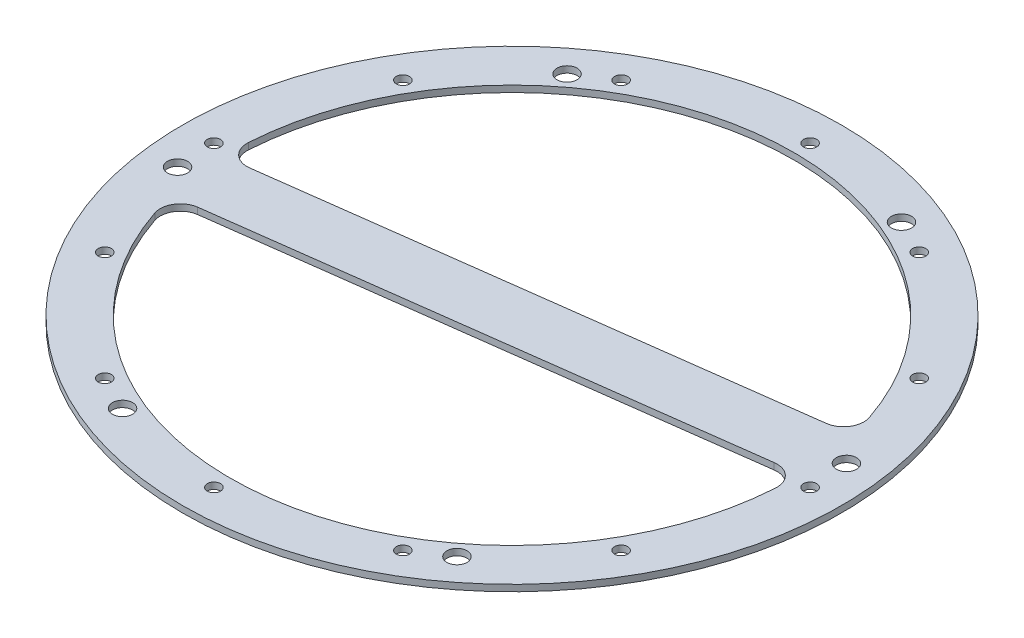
from build123d import *

# Parameters (mm, degrees)
SKETCH1_R             = 81.7
BOSS_EXTRUDE1_DEPTH   = 1.6
F_4_CLEARANCE_HOLE1_D = 3.2639
F_5_0MM_DOWEL_HOLE1_D = 5
FILLET1_R             = 5


with BuildPart() as part:
    # Sketch1 → Boss-Extrude1 (new body)
    with BuildSketch(Plane(origin=(0, 0, 0), x_dir=(1, 0, 0), z_dir=(0, 1, 0))):
        with Locations(Location((0, 0, 0), (0, 0, 270))):
            Circle(SKETCH1_R)
        with BuildLine():
            Line((-69.880869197, -1.635273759), (67.922976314, 16.50694668))
            ThreePointArc((67.922976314, 16.50694668), (-9.123780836, 69.30199581), (-69.880869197, -1.635273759))
        make_face(mode=Mode.SUBTRACT)
        with BuildLine():
            Line((-67.922976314, -16.50694668), (69.880869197, 1.635273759))
            ThreePointArc((69.880869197, 1.635273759), (9.123780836, -69.30199581), (-67.922976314, -16.50694668))
        make_face(mode=Mode.SUBTRACT)
    extrude(amount=BOSS_EXTRUDE1_DEPTH)

    # 4 Clearance Hole1 (through all)
    with Locations(Plane(origin=(0, 1.6, 0), x_dir=(1, 0, 0), z_dir=(0, 1, 0))):
        with Locations((73.9, 0), (63.99927734, -36.95), (36.95, -63.99927734), (0, -73.9), (-36.95, -63.99927734), (-63.99927734, -36.95), (-73.9, 0), (-63.99927734, 36.95), (-36.95, 63.99927734), (0, 73.9), (36.95, 63.99927734), (63.99927734, 36.95)):
            Hole(F_4_CLEARANCE_HOLE1_D / 2)

    # 5.0mm Dowel Hole1 (through all)
    with Locations(Plane(origin=(0, 1.6, 0), x_dir=(1, 0, 0), z_dir=(0, 1, 0))):
        with Locations((73.267775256, 9.645885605), (44.987469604, -58.628811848), (-28.280305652, -68.274697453), (-73.267775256, -9.645885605), (-44.987469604, 58.628811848), (28.280305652, 68.274697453)):
            Hole(F_5_0MM_DOWEL_HOLE1_D / 2)

    # Fillet1
    fillet1_edges = [part.edges().sort_by_distance(p)[0] for p in [
        (-67.922976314, 0.8, 16.50694668),
        (69.880869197, 0.8, -1.635273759),
        (67.922976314, 0.8, -16.50694668),
        (-69.880869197, 0.8, 1.635273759),
    ]]
    fillet(fillet1_edges, radius=FILLET1_R)


solid = part.part
